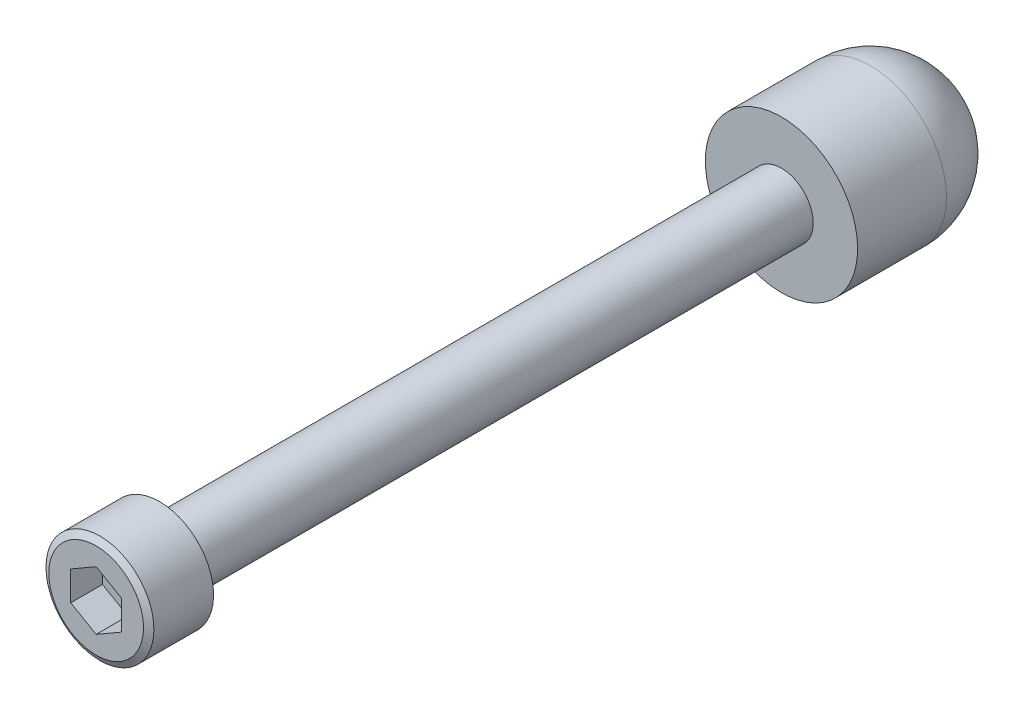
ISO-10303-21;
HEADER;
FILE_DESCRIPTION(('STEP AP214'),'2;1');
FILE_NAME('part.step','',(''),(''),'','','');
FILE_SCHEMA(('AUTOMOTIVE_DESIGN { 1 0 10303 214 1 1 1 1 }'));
ENDSEC;
DATA;
#1=APPLICATION_CONTEXT('core data for automotive mechanical design processes');
#2=APPLICATION_PROTOCOL_DEFINITION('international standard','automotive_design',2000,#1);
#3=PRODUCT_CONTEXT('',#1,'mechanical');
#4=PRODUCT('Part','Part','',(#3));
#5=PRODUCT_RELATED_PRODUCT_CATEGORY('part','',(#4));
#6=PRODUCT_DEFINITION_FORMATION('','',#4);
#7=PRODUCT_DEFINITION_CONTEXT('part definition',#1,'design');
#8=PRODUCT_DEFINITION('design','',#6,#7);
#9=PRODUCT_DEFINITION_SHAPE('','',#8);
#10=(LENGTH_UNIT() NAMED_UNIT(*) SI_UNIT(.MILLI.,.METRE.));
#11=(NAMED_UNIT(*) PLANE_ANGLE_UNIT() SI_UNIT($,.RADIAN.));
#12=(NAMED_UNIT(*) SI_UNIT($,.STERADIAN.) SOLID_ANGLE_UNIT());
#13=UNCERTAINTY_MEASURE_WITH_UNIT(LENGTH_MEASURE(1.E-05),#10,'distance_accuracy_value','');
#14=(GEOMETRIC_REPRESENTATION_CONTEXT(3) GLOBAL_UNCERTAINTY_ASSIGNED_CONTEXT((#13)) GLOBAL_UNIT_ASSIGNED_CONTEXT((#10,
#11,#12)) REPRESENTATION_CONTEXT('',''));
#15=CARTESIAN_POINT('',(0.,0.,0.));
#16=DIRECTION('',(0.,0.,1.));
#17=DIRECTION('',(1.,0.,0.));
#18=AXIS2_PLACEMENT_3D('',#15,#16,#17);
#19=CARTESIAN_POINT('',(-3.775149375,-3.78813948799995,67.));
#20=DIRECTION('',(0.,0.,1.));
#21=DIRECTION('',(1.,0.,0.));
#22=AXIS2_PLACEMENT_3D('',#19,#20,#21);
#23=PLANE('',#22);
#24=DIRECTION('',(-0.866025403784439,0.5,0.));
#25=VECTOR('',#24,1.);
#26=CARTESIAN_POINT('',(2.,1.1547005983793,67.));
#27=LINE('',#26,#25);
#28=CARTESIAN_POINT('',(2.,1.1547005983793,67.));
#29=VERTEX_POINT('',#28);
#30=CARTESIAN_POINT('',(0.,2.30940113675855,67.));
#31=VERTEX_POINT('',#30);
#32=EDGE_CURVE('E31',#29,#31,#27,.T.);
#33=ORIENTED_EDGE('',*,*,#32,.F.);
#34=DIRECTION('',(0.,1.,0.));
#35=VECTOR('',#34,1.);
#36=CARTESIAN_POINT('',(2.,-1.1547004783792,67.));
#37=LINE('',#36,#35);
#38=CARTESIAN_POINT('',(2.,-1.1547004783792,67.));
#39=VERTEX_POINT('',#38);
#40=EDGE_CURVE('E90',#39,#29,#37,.T.);
#41=ORIENTED_EDGE('',*,*,#40,.F.);
#42=DIRECTION('',(0.866025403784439,0.5,0.));
#43=VECTOR('',#42,1.);
#44=CARTESIAN_POINT('',(0.,-2.30940101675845,67.));
#45=LINE('',#44,#43);
#46=CARTESIAN_POINT('',(0.,-2.30940101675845,67.));
#47=VERTEX_POINT('',#46);
#48=EDGE_CURVE('E93',#47,#39,#45,.T.);
#49=ORIENTED_EDGE('',*,*,#48,.F.);
#50=DIRECTION('',(0.866025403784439,-0.5,0.));
#51=VECTOR('',#50,1.);
#52=CARTESIAN_POINT('',(-2.,-1.1547004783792,67.));
#53=LINE('',#52,#51);
#54=CARTESIAN_POINT('',(-2.,-1.1547004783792,67.));
#55=VERTEX_POINT('',#54);
#56=EDGE_CURVE('E109',#55,#47,#53,.T.);
#57=ORIENTED_EDGE('',*,*,#56,.F.);
#58=DIRECTION('',(0.,-1.,0.));
#59=VECTOR('',#58,1.);
#60=CARTESIAN_POINT('',(-2.,1.1547005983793,67.));
#61=LINE('',#60,#59);
#62=CARTESIAN_POINT('',(-2.,1.1547005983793,67.));
#63=VERTEX_POINT('',#62);
#64=EDGE_CURVE('E106',#63,#55,#61,.T.);
#65=ORIENTED_EDGE('',*,*,#64,.F.);
#66=DIRECTION('',(-0.866025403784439,-0.5,0.));
#67=VECTOR('',#66,1.);
#68=CARTESIAN_POINT('',(0.,2.30940113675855,67.));
#69=LINE('',#68,#67);
#70=EDGE_CURVE('E104',#31,#63,#69,.T.);
#71=ORIENTED_EDGE('',*,*,#70,.F.);
#72=EDGE_LOOP('',(#33,#41,#49,#57,#65,#71));
#73=FACE_BOUND('',#72,.T.);
#74=CARTESIAN_POINT('',(0.,6.00000503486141E-08,67.));
#75=DIRECTION('',(0.,0.,-1.));
#76=DIRECTION('',(-1.,0.,0.));
#77=AXIS2_PLACEMENT_3D('',#74,#75,#76);
#78=CIRCLE('',#77,3.730384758);
#79=CARTESIAN_POINT('',(-3.730384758,6.00000503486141E-08,67.));
#80=VERTEX_POINT('',#79);
#81=EDGE_CURVE('E18',#80,#80,#78,.T.);
#82=ORIENTED_EDGE('',*,*,#81,.F.);
#83=EDGE_LOOP('',(#82));
#84=FACE_BOUND('',#83,.T.);
#85=ADVANCED_FACE('F14',(#73,#84),#23,.T.);
#86=CARTESIAN_POINT('',(0.,6.00000503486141E-08,67.));
#87=DIRECTION('',(0.,0.,-1.));
#88=DIRECTION('',(-1.,0.,0.));
#89=AXIS2_PLACEMENT_3D('',#86,#87,#88);
#90=CONICAL_SURFACE('',#89,3.730384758,1.04719755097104);
#91=ORIENTED_EDGE('',*,*,#81,.T.);
#92=EDGE_LOOP('',(#91));
#93=FACE_BOUND('',#92,.T.);
#94=CARTESIAN_POINT('',(0.,6.00000499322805E-08,66.7));
#95=DIRECTION('',(0.,0.,1.));
#96=DIRECTION('',(1.,0.,0.));
#97=AXIS2_PLACEMENT_3D('',#94,#95,#96);
#98=CIRCLE('',#97,4.25);
#99=CARTESIAN_POINT('',(4.25,6.00000499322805E-08,66.7));
#100=VERTEX_POINT('',#99);
#101=EDGE_CURVE('E159',#100,#100,#98,.F.);
#102=ORIENTED_EDGE('',*,*,#101,.F.);
#103=EDGE_LOOP('',(#102));
#104=FACE_BOUND('',#103,.T.);
#105=ADVANCED_FACE('F138',(#93,#104),#90,.T.);
#106=CARTESIAN_POINT('',(0.,6.00000434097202E-08,62.));
#107=DIRECTION('',(0.,0.,1.));
#108=DIRECTION('',(0.,1.,0.));
#109=AXIS2_PLACEMENT_3D('',#106,#107,#108);
#110=CYLINDRICAL_SURFACE('',#109,4.25);
#111=CARTESIAN_POINT('',(0.,6.00000434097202E-08,62.));
#112=DIRECTION('',(0.,0.,1.));
#113=DIRECTION('',(0.,1.,0.));
#114=AXIS2_PLACEMENT_3D('',#111,#112,#113);
#115=CIRCLE('',#114,4.25);
#116=CARTESIAN_POINT('',(0.,4.25000006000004,62.));
#117=VERTEX_POINT('',#116);
#118=EDGE_CURVE('E158',#117,#117,#115,.F.);
#119=ORIENTED_EDGE('',*,*,#118,.F.);
#120=EDGE_LOOP('',(#119));
#121=FACE_BOUND('',#120,.T.);
#122=ORIENTED_EDGE('',*,*,#101,.T.);
#123=EDGE_LOOP('',(#122));
#124=FACE_BOUND('',#123,.T.);
#125=ADVANCED_FACE('F142',(#121,#124),#110,.T.);
#126=CARTESIAN_POINT('',(4.301,-4.31579954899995,62.));
#127=DIRECTION('',(0.,0.,-1.));
#128=DIRECTION('',(-1.,0.,0.));
#129=AXIS2_PLACEMENT_3D('',#126,#127,#128);
#130=PLANE('',#129);
#131=CARTESIAN_POINT('',(0.,5.99999754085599E-08,62.));
#132=DIRECTION('',(0.,0.,1.));
#133=DIRECTION('',(0.,1.,0.));
#134=AXIS2_PLACEMENT_3D('',#131,#132,#133);
#135=CIRCLE('',#134,2.5);
#136=CARTESIAN_POINT('',(0.,2.50000005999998,62.));
#137=VERTEX_POINT('',#136);
#138=EDGE_CURVE('E155',#137,#137,#135,.F.);
#139=ORIENTED_EDGE('',*,*,#138,.F.);
#140=EDGE_LOOP('',(#139));
#141=FACE_BOUND('',#140,.T.);
#142=ORIENTED_EDGE('',*,*,#118,.T.);
#143=EDGE_LOOP('',(#142));
#144=FACE_BOUND('',#143,.T.);
#145=ADVANCED_FACE('F140',(#141,#144),#130,.T.);
#146=CARTESIAN_POINT('',(0.,5.99999754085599E-08,13.));
#147=DIRECTION('',(0.,0.,1.));
#148=DIRECTION('',(0.,1.,0.));
#149=AXIS2_PLACEMENT_3D('',#146,#147,#148);
#150=CYLINDRICAL_SURFACE('',#149,2.5);
#151=CARTESIAN_POINT('',(0.,5.99999754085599E-08,13.));
#152=DIRECTION('',(0.,0.,1.));
#153=DIRECTION('',(0.,1.,0.));
#154=AXIS2_PLACEMENT_3D('',#151,#152,#153);
#155=CIRCLE('',#154,2.5);
#156=CARTESIAN_POINT('',(0.,2.50000005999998,13.));
#157=VERTEX_POINT('',#156);
#158=EDGE_CURVE('E160',#157,#157,#155,.F.);
#159=ORIENTED_EDGE('',*,*,#158,.F.);
#160=EDGE_LOOP('',(#159));
#161=FACE_BOUND('',#160,.T.);
#162=ORIENTED_EDGE('',*,*,#138,.T.);
#163=EDGE_LOOP('',(#162));
#164=FACE_BOUND('',#163,.T.);
#165=ADVANCED_FACE('F132',(#161,#164),#150,.T.);
#166=CARTESIAN_POINT('',(-6.072,-6.09289350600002,13.));
#167=DIRECTION('',(0.,0.,1.));
#168=DIRECTION('',(1.,0.,0.));
#169=AXIS2_PLACEMENT_3D('',#166,#167,#168);
#170=PLANE('',#169);
#171=ORIENTED_EDGE('',*,*,#158,.T.);
#172=EDGE_LOOP('',(#171));
#173=FACE_BOUND('',#172,.T.);
#174=CARTESIAN_POINT('',(0.,5.99999754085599E-08,13.));
#175=DIRECTION('',(0.,0.,1.));
#176=DIRECTION('',(1.,0.,0.));
#177=AXIS2_PLACEMENT_3D('',#174,#175,#176);
#178=CIRCLE('',#177,6.);
#179=CARTESIAN_POINT('',(6.,5.99999754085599E-08,13.));
#180=VERTEX_POINT('',#179);
#181=EDGE_CURVE('E9',#180,#180,#178,.F.);
#182=ORIENTED_EDGE('',*,*,#181,.F.);
#183=EDGE_LOOP('',(#182));
#184=FACE_BOUND('',#183,.T.);
#185=ADVANCED_FACE('F16',(#173,#184),#170,.T.);
#186=CARTESIAN_POINT('',(0.,5.99999656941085E-08,6.));
#187=DIRECTION('',(0.,0.,1.));
#188=DIRECTION('',(0.,-1.,0.));
#189=AXIS2_PLACEMENT_3D('',#186,#187,#188);
#190=SPHERICAL_SURFACE('',#189,6.);
#191=CARTESIAN_POINT('',(0.,0.,0.));
#192=VERTEX_POINT('',#191);
#193=VERTEX_LOOP('',#192);
#194=FACE_BOUND('',#193,.T.);
#195=CARTESIAN_POINT('',(0.,5.99999656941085E-08,6.));
#196=DIRECTION('',(0.,0.,1.));
#197=DIRECTION('',(1.,0.,0.));
#198=AXIS2_PLACEMENT_3D('',#195,#196,#197);
#199=CIRCLE('',#198,6.);
#200=CARTESIAN_POINT('',(6.,5.99999656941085E-08,6.));
#201=VERTEX_POINT('',#200);
#202=EDGE_CURVE('E23',#201,#201,#199,.T.);
#203=ORIENTED_EDGE('',*,*,#202,.F.);
#204=EDGE_LOOP('',(#203));
#205=FACE_BOUND('',#204,.T.);
#206=ADVANCED_FACE('F127',(#194,#205),#190,.T.);
#207=CARTESIAN_POINT('',(0.,5.99999656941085E-08,6.));
#208=DIRECTION('',(0.,0.,1.));
#209=DIRECTION('',(1.,0.,0.));
#210=AXIS2_PLACEMENT_3D('',#207,#208,#209);
#211=CYLINDRICAL_SURFACE('',#210,6.);
#212=ORIENTED_EDGE('',*,*,#181,.T.);
#213=EDGE_LOOP('',(#212));
#214=FACE_BOUND('',#213,.T.);
#215=ORIENTED_EDGE('',*,*,#202,.T.);
#216=EDGE_LOOP('',(#215));
#217=FACE_BOUND('',#216,.T.);
#218=ADVANCED_FACE('F131',(#214,#217),#211,.T.);
#219=CARTESIAN_POINT('',(2.,1.1547005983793,64.5));
#220=DIRECTION('',(0.5,0.866025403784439,0.));
#221=DIRECTION('',(-0.866025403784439,0.5,0.));
#222=AXIS2_PLACEMENT_3D('',#219,#220,#221);
#223=PLANE('',#222);
#224=ORIENTED_EDGE('',*,*,#32,.T.);
#225=DIRECTION('',(0.,0.,1.));
#226=VECTOR('',#225,1.);
#227=CARTESIAN_POINT('',(0.,2.30940113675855,64.5));
#228=LINE('',#227,#226);
#229=CARTESIAN_POINT('',(0.,2.30940113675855,64.5));
#230=VERTEX_POINT('',#229);
#231=EDGE_CURVE('E67',#230,#31,#228,.T.);
#232=ORIENTED_EDGE('',*,*,#231,.F.);
#233=DIRECTION('',(-0.866025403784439,0.5,0.));
#234=VECTOR('',#233,1.);
#235=CARTESIAN_POINT('',(2.,1.1547005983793,64.5));
#236=LINE('',#235,#234);
#237=CARTESIAN_POINT('',(2.,1.1547005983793,64.5));
#238=VERTEX_POINT('',#237);
#239=EDGE_CURVE('E71',#238,#230,#236,.T.);
#240=ORIENTED_EDGE('',*,*,#239,.F.);
#241=DIRECTION('',(0.,0.,1.));
#242=VECTOR('',#241,1.);
#243=CARTESIAN_POINT('',(2.,1.1547005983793,64.5));
#244=LINE('',#243,#242);
#245=EDGE_CURVE('E114',#238,#29,#244,.T.);
#246=ORIENTED_EDGE('',*,*,#245,.T.);
#247=EDGE_LOOP('',(#224,#232,#240,#246));
#248=FACE_BOUND('',#247,.T.);
#249=ADVANCED_FACE('F69',(#248),#223,.F.);
#250=CARTESIAN_POINT('',(2.,-1.15470047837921,64.5));
#251=DIRECTION('',(1.,0.,0.));
#252=DIRECTION('',(0.,0.,-1.));
#253=AXIS2_PLACEMENT_3D('',#250,#251,#252);
#254=PLANE('',#253);
#255=ORIENTED_EDGE('',*,*,#40,.T.);
#256=ORIENTED_EDGE('',*,*,#245,.F.);
#257=DIRECTION('',(0.,1.,0.));
#258=VECTOR('',#257,1.);
#259=CARTESIAN_POINT('',(2.,-1.15470047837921,64.5));
#260=LINE('',#259,#258);
#261=CARTESIAN_POINT('',(2.,-1.15470047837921,64.5));
#262=VERTEX_POINT('',#261);
#263=EDGE_CURVE('E77',#262,#238,#260,.T.);
#264=ORIENTED_EDGE('',*,*,#263,.F.);
#265=DIRECTION('',(0.,0.,1.));
#266=VECTOR('',#265,1.);
#267=CARTESIAN_POINT('',(2.,-1.15470047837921,64.5));
#268=LINE('',#267,#266);
#269=EDGE_CURVE('E116',#262,#39,#268,.T.);
#270=ORIENTED_EDGE('',*,*,#269,.T.);
#271=EDGE_LOOP('',(#255,#256,#264,#270));
#272=FACE_BOUND('',#271,.T.);
#273=ADVANCED_FACE('F203',(#272),#254,.F.);
#274=CARTESIAN_POINT('',(0.,-2.30940101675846,64.5));
#275=DIRECTION('',(0.5,-0.866025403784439,0.));
#276=DIRECTION('',(0.866025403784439,0.5,0.));
#277=AXIS2_PLACEMENT_3D('',#274,#275,#276);
#278=PLANE('',#277);
#279=ORIENTED_EDGE('',*,*,#48,.T.);
#280=ORIENTED_EDGE('',*,*,#269,.F.);
#281=DIRECTION('',(0.866025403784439,0.5,0.));
#282=VECTOR('',#281,1.);
#283=CARTESIAN_POINT('',(0.,-2.30940101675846,64.5));
#284=LINE('',#283,#282);
#285=CARTESIAN_POINT('',(0.,-2.30940101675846,64.5));
#286=VERTEX_POINT('',#285);
#287=EDGE_CURVE('E100',#286,#262,#284,.T.);
#288=ORIENTED_EDGE('',*,*,#287,.F.);
#289=DIRECTION('',(0.,0.,1.));
#290=VECTOR('',#289,1.);
#291=CARTESIAN_POINT('',(0.,-2.30940101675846,64.5));
#292=LINE('',#291,#290);
#293=EDGE_CURVE('E118',#286,#47,#292,.T.);
#294=ORIENTED_EDGE('',*,*,#293,.T.);
#295=EDGE_LOOP('',(#279,#280,#288,#294));
#296=FACE_BOUND('',#295,.T.);
#297=ADVANCED_FACE('F211',(#296),#278,.F.);
#298=CARTESIAN_POINT('',(-2.,-1.15470047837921,64.5));
#299=DIRECTION('',(-0.5,-0.866025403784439,0.));
#300=DIRECTION('',(0.866025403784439,-0.5,0.));
#301=AXIS2_PLACEMENT_3D('',#298,#299,#300);
#302=PLANE('',#301);
#303=ORIENTED_EDGE('',*,*,#56,.T.);
#304=ORIENTED_EDGE('',*,*,#293,.F.);
#305=DIRECTION('',(0.866025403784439,-0.5,0.));
#306=VECTOR('',#305,1.);
#307=CARTESIAN_POINT('',(-2.,-1.15470047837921,64.5));
#308=LINE('',#307,#306);
#309=CARTESIAN_POINT('',(-2.,-1.15470047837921,64.5));
#310=VERTEX_POINT('',#309);
#311=EDGE_CURVE('E97',#310,#286,#308,.T.);
#312=ORIENTED_EDGE('',*,*,#311,.F.);
#313=DIRECTION('',(0.,0.,1.));
#314=VECTOR('',#313,1.);
#315=CARTESIAN_POINT('',(-2.,-1.15470047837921,64.5));
#316=LINE('',#315,#314);
#317=EDGE_CURVE('E120',#310,#55,#316,.T.);
#318=ORIENTED_EDGE('',*,*,#317,.T.);
#319=EDGE_LOOP('',(#303,#304,#312,#318));
#320=FACE_BOUND('',#319,.T.);
#321=ADVANCED_FACE('F220',(#320),#302,.F.);
#322=CARTESIAN_POINT('',(-2.,1.1547005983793,64.5));
#323=DIRECTION('',(-1.,0.,0.));
#324=DIRECTION('',(0.,-1.,0.));
#325=AXIS2_PLACEMENT_3D('',#322,#323,#324);
#326=PLANE('',#325);
#327=ORIENTED_EDGE('',*,*,#64,.T.);
#328=ORIENTED_EDGE('',*,*,#317,.F.);
#329=DIRECTION('',(0.,-1.,0.));
#330=VECTOR('',#329,1.);
#331=CARTESIAN_POINT('',(-2.,1.1547005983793,64.5));
#332=LINE('',#331,#330);
#333=CARTESIAN_POINT('',(-2.,1.1547005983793,64.5));
#334=VERTEX_POINT('',#333);
#335=EDGE_CURVE('E85',#334,#310,#332,.T.);
#336=ORIENTED_EDGE('',*,*,#335,.F.);
#337=DIRECTION('',(0.,0.,1.));
#338=VECTOR('',#337,1.);
#339=CARTESIAN_POINT('',(-2.,1.1547005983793,64.5));
#340=LINE('',#339,#338);
#341=EDGE_CURVE('E76',#334,#63,#340,.T.);
#342=ORIENTED_EDGE('',*,*,#341,.T.);
#343=EDGE_LOOP('',(#327,#328,#336,#342));
#344=FACE_BOUND('',#343,.T.);
#345=ADVANCED_FACE('F229',(#344),#326,.F.);
#346=CARTESIAN_POINT('',(0.,2.30940113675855,64.5));
#347=DIRECTION('',(-0.5,0.866025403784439,0.));
#348=DIRECTION('',(-0.866025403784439,-0.5,0.));
#349=AXIS2_PLACEMENT_3D('',#346,#347,#348);
#350=PLANE('',#349);
#351=ORIENTED_EDGE('',*,*,#70,.T.);
#352=ORIENTED_EDGE('',*,*,#341,.F.);
#353=DIRECTION('',(-0.866025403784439,-0.5,0.));
#354=VECTOR('',#353,1.);
#355=CARTESIAN_POINT('',(0.,2.30940113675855,64.5));
#356=LINE('',#355,#354);
#357=EDGE_CURVE('E80',#230,#334,#356,.T.);
#358=ORIENTED_EDGE('',*,*,#357,.F.);
#359=ORIENTED_EDGE('',*,*,#231,.T.);
#360=EDGE_LOOP('',(#351,#352,#358,#359));
#361=FACE_BOUND('',#360,.T.);
#362=ADVANCED_FACE('F81',(#361),#350,.F.);
#363=CARTESIAN_POINT('',(0.,2.30940113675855,64.5));
#364=DIRECTION('',(0.,0.,1.));
#365=DIRECTION('',(1.,0.,0.));
#366=AXIS2_PLACEMENT_3D('',#363,#364,#365);
#367=PLANE('',#366);
#368=ORIENTED_EDGE('',*,*,#239,.T.);
#369=ORIENTED_EDGE('',*,*,#357,.T.);
#370=ORIENTED_EDGE('',*,*,#335,.T.);
#371=ORIENTED_EDGE('',*,*,#311,.T.);
#372=ORIENTED_EDGE('',*,*,#287,.T.);
#373=ORIENTED_EDGE('',*,*,#263,.T.);
#374=EDGE_LOOP('',(#368,#369,#370,#371,#372,#373));
#375=FACE_BOUND('',#374,.T.);
#376=ADVANCED_FACE('F87',(#375),#367,.T.);
#377=CLOSED_SHELL('',(#85,#105,#125,#145,#165,#185,#206,#218,#249,#273,#297,#321,#345,#362,#376));
#378=MANIFOLD_SOLID_BREP('B1',#377);
#379=ADVANCED_BREP_SHAPE_REPRESENTATION('',(#18,#378),#14);
#380=SHAPE_DEFINITION_REPRESENTATION(#9,#379);
ENDSEC;
END-ISO-10303-21;
